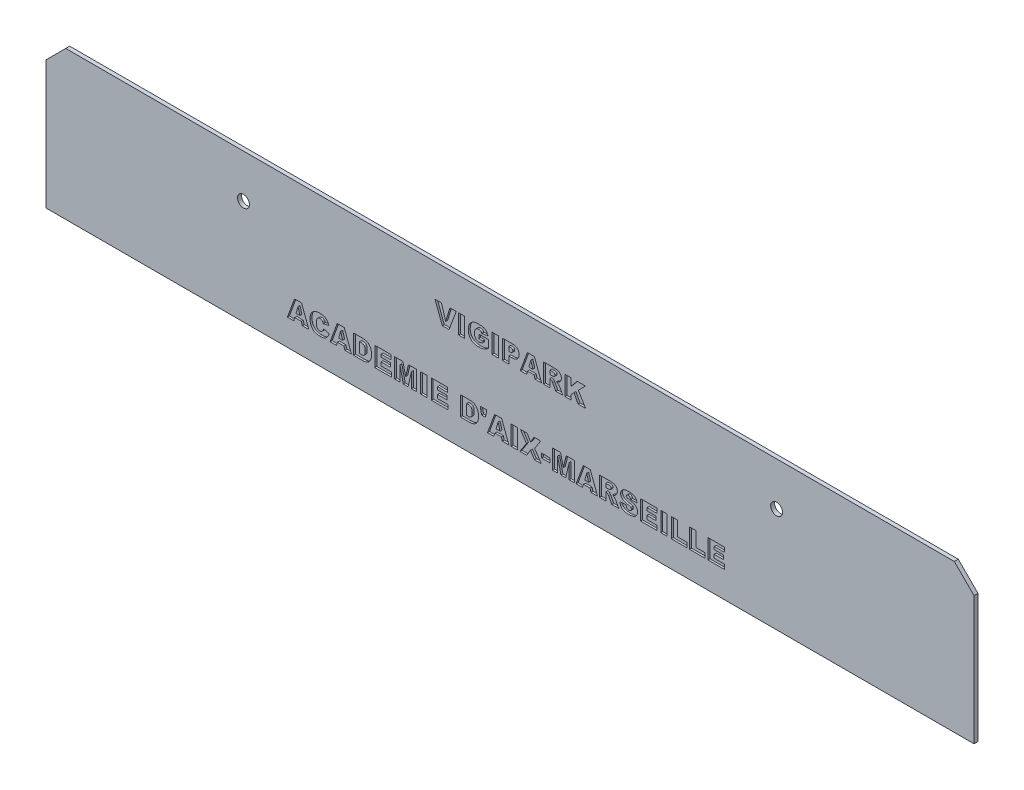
from build123d import *

# Parameters (mm, degrees)
PLAQUE_DE_BASE_DEPTH   = 1
TROU_RIVETS_DEPTH      = 247.679954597
TROU_RIVETS_DEPTH_BACK = 247.679954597
ESQUISSE2_R            = 3
ESQUISSE3_W            = 3.168127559
ESQUISSE3_H            = 9.757832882
ESQUISSE3_W_2          = 3.178840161
ESQUISSE3_H_2          = 9.790827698
ESQUISSE3_W_3          = 3.178840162
ESQUISSE3_W_4          = 4.196069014
ESQUISSE3_H_3          = 2.16161131
TESTE_DEPTH            = 1


with BuildPart() as part:
    # Esquisse1 → Plaque de base (new, symmetric)
    with BuildSketch(Plane.XY):
        Polygon((-235, 65), (-225, 75), (225, 75), (235, 65), (235, 0), (-235, 0), align=None)
    extrude(amount=PLAQUE_DE_BASE_DEPTH, both=True)

    # Esquisse2 → Trou rivets (cut, two sides: drawn at the far end of the back side and taken through both)
    with BuildSketch(Plane.XY.offset(-TROU_RIVETS_DEPTH_BACK)):
        with Locations((-135, 53)):
            Circle(ESQUISSE2_R)
        with Locations((135, 53)):
            Circle(ESQUISSE2_R)
    extrude(amount=TROU_RIVETS_DEPTH + TROU_RIVETS_DEPTH_BACK, mode=Mode.SUBTRACT)

    # Esquisse3 → Teste (cut)
    # profile 1 of 31: a face of its own
    with BuildSketch(Plane.XY.offset(1)):
        Polygon((-38.01102416, 58.524643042), (-34.716171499, 58.524643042), (-32.563824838, 51.503280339), (-30.441179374, 58.524643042), (-27.239390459, 58.524643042), (-30.884717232, 48.76681016), (-34.300354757, 48.76681016), align=None)
    # profile 2 of 31: a face of its own
    with BuildSketch(Plane.XY.offset(1)):
        with Locations((-24.514800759, 53.645726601)):
            Rectangle(ESQUISSE3_W, ESQUISSE3_H)
    # profile 3 of 31: a face of its own
    with BuildSketch(Plane.XY.offset(1)):
        with BuildLine():
            Line((-15.834131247, 52.315113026), (-15.834131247, 54.342714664))
            Line((-15.834131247, 54.342714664), (-11.018577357, 54.342714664))
            Line((-11.018577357, 54.342714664), (-11.018577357, 50.317212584))
            add(Edge.make_bspline(
                [(-11.018577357, 50.317212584), (-11.128993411, 50.238648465), (-11.344572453, 50.085257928), (-11.668280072, 49.871925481), (-11.979534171, 49.675424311), (-12.282768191, 49.499864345), (-12.576069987, 49.344053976), (-12.860289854, 49.207130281), (-13.132751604, 49.086960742), (-13.401298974, 48.988006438), (-13.673374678, 48.906104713), (-13.956886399, 48.835048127), (-14.256018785, 48.77345227), (-14.571230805, 48.724182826), (-14.902312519, 48.68746603), (-15.249593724, 48.659181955), (-15.612885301, 48.643954), (-15.860519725, 48.641390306), (-15.986597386, 48.640085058)],
                knots=[0, 0, 0, 0, 1.214319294, 2.370867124, 3.473714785, 4.512576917, 5.510103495, 6.449244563, 7.339308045, 8.177675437, 9.012194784, 9.884410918, 10.796182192, 11.748198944, 12.742352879, 13.780760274, 14.870122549, 16, 16, 16, 16], degree=3))
            add(Edge.make_bspline(
                [(-15.986597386, 48.640085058), (-16.129208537, 48.642052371), (-16.408105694, 48.645899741), (-16.815843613, 48.673933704), (-17.203131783, 48.719180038), (-17.570408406, 48.781553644), (-17.917486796, 48.864974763), (-18.244974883, 48.96584964), (-18.552982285, 49.083539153), (-18.839626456, 49.223541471), (-19.108573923, 49.381102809), (-19.362398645, 49.555312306), (-19.600917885, 49.747114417), (-19.821203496, 49.959788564), (-20.029920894, 50.186084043), (-20.220208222, 50.433265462), (-20.39456216, 50.697861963), (-20.554614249, 50.977981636), (-20.697116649, 51.272930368), (-20.820244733, 51.580572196), (-20.922114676, 51.899305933), (-21.007948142, 52.227713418), (-21.075560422, 52.566783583), (-21.122548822, 52.917292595), (-21.15054036, 53.278293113), (-21.154554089, 53.522252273), (-21.156585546, 53.645726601)],
                knots=[0, 0, 0, 0, 1.253917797, 2.452221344, 3.591772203, 4.681385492, 5.725859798, 6.728156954, 7.692763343, 8.621995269, 9.52977499, 10.431262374, 11.326770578, 12.217527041, 13.121290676, 14.03140493, 14.956950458, 15.905713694, 16.866120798, 17.834977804, 18.81688793, 19.806469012, 20.818314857, 21.854955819, 22.914335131, 24, 24, 24, 24], degree=3))
            add(Edge.make_bspline(
                [(-21.156585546, 53.645726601), (-21.154956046, 53.775826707), (-21.151749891, 54.031807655), (-21.118305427, 54.409184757), (-21.068382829, 54.773830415), (-20.994164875, 55.125416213), (-20.901628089, 55.464209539), (-20.78852972, 55.790626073), (-20.654144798, 56.103969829), (-20.496938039, 56.40323441), (-20.321870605, 56.687753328), (-20.126358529, 56.955651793), (-19.910355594, 57.204576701), (-19.676006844, 57.436827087), (-19.423445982, 57.652663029), (-19.149406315, 57.847411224), (-18.857812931, 58.027812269), (-18.651345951, 58.130242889), (-18.546840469, 58.182089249)],
                knots=[0, 0, 0, 0, 1.125501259, 2.214501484, 3.275832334, 4.308594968, 5.321456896, 6.313082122, 7.295503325, 8.268817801, 9.235659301, 10.183814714, 11.135352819, 12.084419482, 13.036574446, 14.006582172, 14.991010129, 16, 16, 16, 16], degree=3))
            add(Edge.make_bspline(
                [(-18.546840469, 58.182089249), (-18.460262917, 58.220411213), (-18.28317966, 58.298793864), (-17.99945616, 58.393362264), (-17.694471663, 58.470569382), (-17.368513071, 58.539355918), (-17.020596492, 58.589701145), (-16.651159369, 58.624545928), (-16.260777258, 58.64671684), (-15.993228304, 58.649790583), (-15.855912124, 58.651368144)],
                knots=[0, 0, 0, 0, 0.82525077, 1.687944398, 2.603683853, 3.567637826, 4.591578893, 5.667081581, 6.802658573, 8, 8, 8, 8], degree=3))
            add(Edge.make_bspline(
                [(-15.855912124, 58.651368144), (-15.713993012, 58.6508328), (-15.440640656, 58.649801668), (-15.045136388, 58.635665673), (-14.679869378, 58.612947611), (-14.343860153, 58.578628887), (-14.037655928, 58.538784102), (-13.760764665, 58.487054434), (-13.513472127, 58.427563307), (-13.226754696, 58.331837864), (-12.901202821, 58.190119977), (-12.545247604, 57.976266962), (-12.223664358, 57.721350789), (-11.938264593, 57.422856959), (-11.687715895, 57.082688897), (-11.46914147, 56.701568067), (-11.283828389, 56.277863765), (-11.192345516, 55.975393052), (-11.14530246, 55.819854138)],
                knots=[0, 0, 0, 0, 1.126010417, 2.168824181, 3.139711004, 4.029235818, 4.848391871, 5.588964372, 6.263424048, 6.864588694, 7.985509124, 9.073161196, 10.150323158, 11.231868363, 12.340041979, 13.49434115, 14.711520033, 16, 16, 16, 16], degree=3))
            Line((-11.14530246, 55.819854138), (-14.30748978, 55.356515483))
            add(Edge.make_bspline(
                [(-14.30748978, 55.356515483), (-14.340814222, 55.434885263), (-14.406056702, 55.588317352), (-14.541988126, 55.795792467), (-14.712117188, 55.970296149), (-14.910544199, 56.116459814), (-15.138434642, 56.232217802), (-15.396112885, 56.312332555), (-15.68166586, 56.362883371), (-15.882083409, 56.367768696), (-15.986597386, 56.370316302)],
                knots=[0, 0, 0, 0, 0.970787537, 1.900604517, 2.811676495, 3.738344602, 4.701943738, 5.714510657, 6.808160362, 8, 8, 8, 8], degree=3))
            add(Edge.make_bspline(
                [(-15.986597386, 56.370316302), (-16.056001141, 56.368458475), (-16.192167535, 56.364813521), (-16.392272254, 56.334723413), (-16.583271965, 56.282674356), (-16.766577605, 56.211108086), (-16.941714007, 56.119275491), (-17.108643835, 56.00819726), (-17.266330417, 55.875782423), (-17.414419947, 55.723923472), (-17.551207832, 55.549936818), (-17.669444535, 55.351674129), (-17.768509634, 55.129381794), (-17.849369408, 54.884500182), (-17.912030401, 54.616063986), (-17.957397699, 54.324891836), (-17.982211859, 54.009831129), (-17.986323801, 53.792294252), (-17.988457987, 53.679387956)],
                knots=[0, 0, 0, 0, 0.880234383, 1.726971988, 2.559807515, 3.387067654, 4.218555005, 5.063925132, 5.925927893, 6.826012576, 7.750652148, 8.727184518, 9.746611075, 10.832289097, 11.994062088, 13.239971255, 14.567486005, 16, 16, 16, 16], degree=3))
            add(Edge.make_bspline(
                [(-17.988457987, 53.679387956), (-17.986510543, 53.559872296), (-17.982760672, 53.32974067), (-17.955562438, 52.997551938), (-17.908242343, 52.691877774), (-17.843846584, 52.412167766), (-17.761245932, 52.158252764), (-17.658297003, 51.93068871), (-17.535753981, 51.729336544), (-17.393524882, 51.555040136), (-17.235632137, 51.406744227), (-17.068096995, 51.277500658), (-16.891367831, 51.164049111), (-16.70061746, 51.076652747), (-16.5006738, 51.005837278), (-16.290117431, 50.957162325), (-16.06868897, 50.926433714), (-15.917399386, 50.922928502), (-15.840071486, 50.9211369)],
                knots=[0, 0, 0, 0, 1.441714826, 2.776072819, 4.017058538, 5.170071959, 6.235138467, 7.232804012, 8.176421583, 9.070535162, 9.937871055, 10.783556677, 11.620804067, 12.464989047, 13.308573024, 14.175726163, 15.067567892, 16, 16, 16, 16], degree=3))
            add(Edge.make_bspline(
                [(-15.840071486, 50.9211369), (-15.756168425, 50.922416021), (-15.58927936, 50.924960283), (-15.342811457, 50.95273166), (-15.101564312, 50.990804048), (-14.863434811, 51.049996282), (-14.619948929, 51.129621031), (-14.362490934, 51.22857035), (-14.088514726, 51.352223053), (-13.903124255, 51.447629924), (-13.806529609, 51.4973401)],
                knots=[0, 0, 0, 0, 0.941933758, 1.873572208, 2.782730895, 3.683509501, 4.625939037, 5.658467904, 6.779983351, 8, 8, 8, 8], degree=3))
            Line((-13.806529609, 51.4973401), (-13.806529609, 52.315113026))
            Line((-13.806529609, 52.315113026), (-15.834131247, 52.315113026))
        make_face()
    # profile 4 of 31: a face of its own
    with BuildSketch(Plane.XY.offset(1)):
        with Locations((-7.533637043, 53.645726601)):
            Rectangle(ESQUISSE3_W, ESQUISSE3_H)
    # profile 5 of 31: a face of its own
    with BuildSketch(Plane.XY.offset(1)):
        with BuildLine():
            Line((-3.795246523, 58.524643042), (1.190594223, 58.524643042))
            add(Edge.make_bspline(
                [(1.190594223, 58.524643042), (1.331929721, 58.522681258), (1.605897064, 58.5188785), (2.00158314, 58.480710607), (2.36830094, 58.419808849), (2.705740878, 58.336489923), (3.013665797, 58.224924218), (3.291947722, 58.089157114), (3.540274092, 57.927009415), (3.760364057, 57.741971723), (3.950769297, 57.532171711), (4.116744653, 57.3022911), (4.257371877, 57.05184997), (4.373513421, 56.780707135), (4.459456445, 56.487148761), (4.52189608, 56.173740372), (4.563350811, 55.840094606), (4.566827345, 55.610754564), (4.568610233, 55.493140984)],
                knots=[0, 0, 0, 0, 1.303628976, 2.526978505, 3.663205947, 4.730994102, 5.728827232, 6.679250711, 7.58115036, 8.458288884, 9.324623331, 10.188235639, 11.068918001, 11.969233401, 12.903603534, 13.885252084, 14.915483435, 16, 16, 16, 16], degree=3))
            add(Edge.make_bspline(
                [(4.568610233, 55.493140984), (4.566193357, 55.371550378), (4.561489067, 55.134882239), (4.517922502, 54.790687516), (4.453300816, 54.466187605), (4.353751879, 54.16340367), (4.23305357, 53.878120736), (4.078108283, 53.61595975), (3.899967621, 53.372219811), (3.691796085, 53.151027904), (3.455426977, 52.950354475), (3.182518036, 52.780012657), (2.87783189, 52.635901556), (2.541534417, 52.516989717), (2.171923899, 52.426673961), (1.769932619, 52.362820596), (1.335283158, 52.322798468), (1.034918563, 52.317731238), (0.879721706, 52.315113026)],
                knots=[0, 0, 0, 0, 1.047130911, 2.038171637, 2.985073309, 3.893273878, 4.779632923, 5.648674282, 6.510822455, 7.375835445, 8.259783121, 9.174848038, 10.138893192, 11.158737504, 12.242833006, 13.412410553, 14.663005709, 16, 16, 16, 16], degree=3))
            Line((0.879721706, 52.315113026), (-0.627118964, 52.315113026))
            Line((-0.627118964, 52.315113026), (-0.627118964, 48.76681016))
            Line((-0.627118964, 48.76681016), (-3.795246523, 48.76681016))
            Line((-3.795246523, 48.76681016), (-3.795246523, 58.524643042))
        make_face()
        with BuildLine():
            Line((-0.627118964, 54.342714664), (-0.066756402, 54.342714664))
            add(Edge.make_bspline(
                [(-0.066756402, 54.342714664), (-0.001386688, 54.343258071), (0.124235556, 54.344302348), (0.304788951, 54.35820343), (0.470314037, 54.381439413), (0.620417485, 54.415188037), (0.756244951, 54.45573245), (0.876469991, 54.507649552), (0.981816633, 54.568525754), (1.100409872, 54.66117328), (1.221396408, 54.795845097), (1.326409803, 54.981684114), (1.39071472, 55.189342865), (1.397159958, 55.334925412), (1.400482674, 55.409977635)],
                knots=[0, 0, 0, 0, 1.140602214, 2.191917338, 3.157925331, 4.054994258, 4.874779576, 5.628012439, 6.335275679, 6.991953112, 8.247986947, 9.465288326, 10.693279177, 12, 12, 12, 12], degree=3))
            add(Edge.make_bspline(
                [(1.400482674, 55.409977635), (1.397364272, 55.483608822), (1.391318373, 55.626363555), (1.335332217, 55.831288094), (1.24526039, 56.018298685), (1.140353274, 56.158366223), (1.037269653, 56.259539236), (0.939199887, 56.322166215), (0.828950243, 56.378266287), (0.701169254, 56.420828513), (0.559781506, 56.45704435), (0.401047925, 56.478951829), (0.227993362, 56.496166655), (0.106882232, 56.496742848), (0.044128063, 56.497041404)],
                knots=[0, 0, 0, 0, 1.331134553, 2.580778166, 3.815700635, 5.070763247, 5.730238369, 6.419791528, 7.168166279, 7.965798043, 8.852899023, 9.808015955, 10.864215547, 12, 12, 12, 12], degree=3))
            Line((0.044128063, 56.497041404), (-0.627118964, 56.497041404))
            Line((-0.627118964, 56.497041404), (-0.627118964, 54.342714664))
        make_face(mode=Mode.SUBTRACT)
    # profile 6 of 31: a face of its own
    with BuildSketch(Plane.XY.offset(1)):
        Polygon((12.182016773, 50.414236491), (8.910925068, 50.414236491), (8.417885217, 48.76681016), (5.202235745, 48.76681016), (8.778259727, 58.524643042), (12.336462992, 58.524643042), (15.973869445, 48.76681016), (12.675056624, 48.76681016), align=None)
        Polygon((11.536510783, 52.568563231), (10.522709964, 56.029742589), (9.554450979, 52.568563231), align=None, mode=Mode.SUBTRACT)
    # profile 7 of 31: a face of its own
    with BuildSketch(Plane.XY.offset(1)):
        with BuildLine():
            Line((16.987670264, 48.76681016), (16.987670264, 58.524643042))
            Line((16.987670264, 58.524643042), (22.050734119, 58.524643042))
            add(Edge.make_bspline(
                [(22.050734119, 58.524643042), (22.174831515, 58.523989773), (22.414506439, 58.522728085), (22.761074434, 58.510107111), (23.082669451, 58.49303923), (23.380058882, 58.468373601), (23.652668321, 58.432277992), (23.900357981, 58.390932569), (24.123894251, 58.345156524), (24.324323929, 58.285930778), (24.509859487, 58.221005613), (24.682969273, 58.14159695), (24.845896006, 58.046753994), (25.002221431, 57.943540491), (25.147979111, 57.824774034), (25.285197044, 57.694382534), (25.411375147, 57.548611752), (25.530137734, 57.393210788), (25.637479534, 57.226731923), (25.730550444, 57.049733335), (25.810258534, 56.86391163), (25.872424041, 56.668424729), (25.9254132, 56.465947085), (25.960575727, 56.253222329), (25.979703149, 56.031417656), (25.98331697, 55.880611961), (25.985152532, 55.8040135)],
                knots=[0, 0, 0, 0, 1.62468293, 3.137823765, 4.539895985, 5.840971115, 7.043591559, 8.138909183, 9.128722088, 10.02847004, 10.873079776, 11.700540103, 12.51728205, 13.339355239, 14.150454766, 14.975565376, 15.814497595, 16.671744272, 17.534677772, 18.404420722, 19.287202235, 20.178067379, 21.087679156, 22.025305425, 22.996997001, 24, 24, 24, 24], degree=3))
            add(Edge.make_bspline(
                [(25.985152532, 55.8040135), (25.981391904, 55.673011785), (25.974064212, 55.417751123), (25.905015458, 55.049525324), (25.794488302, 54.70754446), (25.636532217, 54.395921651), (25.440580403, 54.112669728), (25.21078833, 53.85758875), (24.948127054, 53.628629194), (24.750697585, 53.503335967), (24.650578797, 53.43979831)],
                knots=[0, 0, 0, 0, 1.101993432, 2.147266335, 3.141901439, 4.118584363, 5.077365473, 6.033582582, 7.002806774, 8, 8, 8, 8], degree=3))
            add(Edge.make_bspline(
                [(24.650578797, 53.43979831), (24.579264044, 53.401530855), (24.427547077, 53.320119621), (24.172624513, 53.218817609), (23.880731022, 53.12890723), (23.672724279, 53.078282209), (23.563515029, 53.051702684)],
                knots=[0, 0, 0, 0, 0.837915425, 1.782604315, 2.835806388, 4, 4, 4, 4], degree=3))
            add(Edge.make_bspline(
                [(23.563515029, 53.051702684), (23.647041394, 53.022289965), (23.803093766, 52.96733816), (24.016492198, 52.876395), (24.193854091, 52.784932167), (24.295339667, 52.716595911), (24.34168636, 52.685387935)],
                knots=[0, 0, 0, 0, 1.231012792, 2.299902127, 3.223594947, 4, 4, 4, 4], degree=3))
            add(Edge.make_bspline(
                [(24.34168636, 52.685387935), (24.372529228, 52.66017746), (24.444238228, 52.601563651), (24.553365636, 52.486767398), (24.681334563, 52.338117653), (24.820000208, 52.164036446), (24.957982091, 51.986105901), (25.076737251, 51.820700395), (25.169589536, 51.678403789), (25.217394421, 51.588721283), (25.238662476, 51.548822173)],
                knots=[0, 0, 0, 0, 0.656872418, 1.527214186, 2.608218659, 3.894218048, 5.199173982, 6.323536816, 7.254153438, 8, 8, 8, 8], degree=3))
            Line((25.238662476, 51.548822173), (26.745503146, 48.76681016))
            Line((26.745503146, 48.76681016), (23.187299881, 48.76681016))
            Line((23.187299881, 48.76681016), (21.583435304, 51.725049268))
            add(Edge.make_bspline(
                [(21.583435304, 51.725049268), (21.535239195, 51.812985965), (21.446277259, 51.975302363), (21.305307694, 52.187500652), (21.17658122, 52.355392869), (21.079819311, 52.435870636), (21.0369333, 52.471539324)],
                knots=[0, 0, 0, 0, 1.29093653, 2.38285239, 3.283261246, 4, 4, 4, 4], degree=3))
            add(Edge.make_bspline(
                [(21.0369333, 52.471539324), (20.981740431, 52.505617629), (20.871495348, 52.573687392), (20.689625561, 52.644673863), (20.496415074, 52.687757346), (20.363935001, 52.692745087), (20.296383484, 52.695288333)],
                knots=[0, 0, 0, 0, 0.98982165, 1.977120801, 2.968535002, 4, 4, 4, 4], degree=3))
            Line((20.296383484, 52.695288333), (20.155797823, 52.695288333))
            Line((20.155797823, 52.695288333), (20.155797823, 48.76681016))
            Line((20.155797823, 48.76681016), (16.987670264, 48.76681016))
        make_face()
        with BuildLine():
            Line((20.155797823, 54.596164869), (21.318104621, 54.596164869))
            add(Edge.make_bspline(
                [(21.318104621, 54.596164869), (21.361061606, 54.598198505), (21.463910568, 54.603067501), (21.642093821, 54.629818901), (21.869232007, 54.669117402), (22.036315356, 54.703843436), (22.127957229, 54.722889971)],
                knots=[0, 0, 0, 0, 0.628542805, 1.504876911, 2.631474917, 4, 4, 4, 4], degree=3))
            add(Edge.make_bspline(
                [(22.127957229, 54.722889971), (22.176747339, 54.734269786), (22.273398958, 54.756812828), (22.406116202, 54.82203232), (22.526382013, 54.906415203), (22.628203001, 55.013345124), (22.711088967, 55.136206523), (22.773276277, 55.268822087), (22.810591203, 55.411271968), (22.814851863, 55.508760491), (22.817024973, 55.558483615)],
                knots=[0, 0, 0, 0, 1.020158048, 2.02089986, 2.99701443, 4.007421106, 5.016748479, 6.011755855, 6.985914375, 8, 8, 8, 8], degree=3))
            add(Edge.make_bspline(
                [(22.817024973, 55.558483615), (22.813258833, 55.630108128), (22.806086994, 55.766502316), (22.750663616, 55.959991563), (22.649970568, 56.12362078), (22.537623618, 56.238420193), (22.427110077, 56.315340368), (22.324630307, 56.364245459), (22.206154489, 56.40489333), (22.070887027, 56.438339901), (21.920264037, 56.466290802), (21.752001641, 56.482446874), (21.567790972, 56.495255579), (21.438917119, 56.496428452), (21.371566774, 56.497041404)],
                knots=[0, 0, 0, 0, 1.307875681, 2.490580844, 3.632121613, 4.783239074, 5.398689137, 6.08357963, 6.850117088, 7.683629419, 8.627346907, 9.646048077, 10.76980885, 12, 12, 12, 12], degree=3))
            Line((21.371566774, 56.497041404), (20.155797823, 56.497041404))
            Line((20.155797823, 56.497041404), (20.155797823, 54.596164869))
        make_face(mode=Mode.SUBTRACT)
    # profile 8 of 31: a face of its own
    with BuildSketch(Plane.XY.offset(1)):
        Polygon((27.759303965, 58.524643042), (30.927431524, 58.524643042), (30.923471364, 54.837734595), (33.982694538, 58.524643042), (38.150762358, 58.524643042), (34.586618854, 54.87337603), (38.277487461, 48.76681016), (34.434152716, 48.76681016), (32.438232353, 52.758650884), (30.927431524, 51.125085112), (30.927431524, 48.76681016), (27.759303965, 48.76681016), align=None)
    # profile 9 of 31: a face of its own
    with BuildSketch(Plane.XY.offset(1)):
        Polygon((-105.73771511, 14.949012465), (-109.019867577, 14.949012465), (-109.514574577, 13.296015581), (-112.741097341, 13.296015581), (-109.152981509, 23.086843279), (-105.582746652, 23.086843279), (-101.933040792, 13.296015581), (-105.24300811, 13.296015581), align=None)
        Polygon((-106.385403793, 17.110623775), (-107.402632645, 20.583506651), (-108.374165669, 17.110623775), align=None, mode=Mode.SUBTRACT)
    # profile 10 of 31: a face of its own
    with BuildSketch(Plane.XY.offset(1)):
        with BuildLine():
            Line((-94.42303091, 17.364930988), (-91.633598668, 16.562273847))
            add(Edge.make_bspline(
                [(-91.633598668, 16.562273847), (-91.656595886, 16.470649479), (-91.702035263, 16.289612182), (-91.783880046, 16.025829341), (-91.874179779, 15.773361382), (-91.977807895, 15.533932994), (-92.084372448, 15.303096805), (-92.207191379, 15.086939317), (-92.336422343, 14.880903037), (-92.51960661, 14.623958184), (-92.77395848, 14.330237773), (-93.114559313, 14.019960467), (-93.492291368, 13.757703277), (-93.83455896, 13.577446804), (-94.129965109, 13.458540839), (-94.372015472, 13.381779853), (-94.631021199, 13.313929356), (-94.909890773, 13.260711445), (-95.206358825, 13.219713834), (-95.521889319, 13.190097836), (-95.855283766, 13.172083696), (-96.083951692, 13.169953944), (-96.201194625, 13.168861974)],
                knots=[0, 0, 0, 0, 0.905665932, 1.789472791, 2.647230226, 3.475229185, 4.290467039, 5.083667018, 5.857098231, 6.621878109, 8.107598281, 9.573205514, 11.028305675, 12.505342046, 13.271833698, 14.079143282, 14.938591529, 15.837777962, 16.799608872, 17.807463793, 18.875839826, 20, 20, 20, 20], degree=3))
            add(Edge.make_bspline(
                [(-96.201194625, 13.168861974), (-96.331681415, 13.170672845), (-96.586182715, 13.174204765), (-96.958796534, 13.193399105), (-97.312992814, 13.228491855), (-97.648760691, 13.281245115), (-97.96770627, 13.343130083), (-98.267491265, 13.422758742), (-98.548896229, 13.516186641), (-98.813695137, 13.6237366), (-99.065716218, 13.749868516), (-99.305217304, 13.899760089), (-99.537962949, 14.06928666), (-99.75951812, 14.263095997), (-99.974946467, 14.476338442), (-100.182604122, 14.711065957), (-100.377565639, 14.970632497), (-100.567661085, 15.247484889), (-100.740642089, 15.546595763), (-100.890261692, 15.868330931), (-101.01462091, 16.21115116), (-101.11746571, 16.573116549), (-101.199674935, 16.954550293), (-101.256434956, 17.356888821), (-101.290197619, 17.779584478), (-101.294884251, 18.068186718), (-101.297272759, 18.215270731)],
                knots=[0, 0, 0, 0, 1.147650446, 2.238376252, 3.280413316, 4.276323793, 5.226689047, 6.13651372, 7.002182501, 7.832854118, 8.648150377, 9.477309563, 10.314915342, 11.177895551, 12.063382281, 12.979505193, 13.931243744, 14.916675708, 15.931699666, 16.966189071, 18.033078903, 19.13554484, 20.273354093, 21.461953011, 22.706502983, 24, 24, 24, 24], degree=3))
            add(Edge.make_bspline(
                [(-101.297272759, 18.215270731), (-101.293933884, 18.410164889), (-101.287431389, 18.789723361), (-101.223293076, 19.34152957), (-101.126694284, 19.860067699), (-100.98587082, 20.343719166), (-100.802111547, 20.790575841), (-100.581227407, 21.204278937), (-100.316928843, 21.581644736), (-100.014337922, 21.924958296), (-99.673837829, 22.229224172), (-99.299014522, 22.493530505), (-98.890472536, 22.717359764), (-98.448509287, 22.899448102), (-97.9731103, 23.041069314), (-97.464849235, 23.140703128), (-96.923324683, 23.203910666), (-96.551048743, 23.210577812), (-96.360136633, 23.213996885)],
                knots=[0, 0, 0, 0, 1.16882947, 2.276307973, 3.328298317, 4.330369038, 5.292534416, 6.222298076, 7.138273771, 8.050302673, 8.962002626, 9.87147472, 10.796156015, 11.750975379, 12.733998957, 13.767258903, 14.854996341, 16, 16, 16, 16], degree=3))
            add(Edge.make_bspline(
                [(-96.360136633, 23.213996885), (-96.200467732, 23.21181446), (-95.889979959, 23.207570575), (-95.438749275, 23.171789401), (-95.016295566, 23.111910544), (-94.62162468, 23.03290335), (-94.256898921, 22.924167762), (-93.918486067, 22.796591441), (-93.610172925, 22.641075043), (-93.327588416, 22.462473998), (-93.070468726, 22.257379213), (-92.830101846, 22.030239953), (-92.609603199, 21.775090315), (-92.401780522, 21.497806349), (-92.215681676, 21.191153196), (-92.04491284, 20.861360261), (-91.891035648, 20.506091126), (-91.804841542, 20.257618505), (-91.760752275, 20.130521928)],
                knots=[0, 0, 0, 0, 1.271753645, 2.473017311, 3.602533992, 4.66921214, 5.675754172, 6.630957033, 7.54633312, 8.421485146, 9.289035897, 10.162198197, 11.051998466, 11.972029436, 12.91931864, 13.905569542, 14.928674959, 16, 16, 16, 16], degree=3))
            Line((-91.760752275, 20.130521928), (-94.550184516, 19.526542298))
            add(Edge.make_bspline(
                [(-94.550184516, 19.526542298), (-94.573914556, 19.597686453), (-94.618234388, 19.730560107), (-94.691711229, 19.912684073), (-94.76562519, 20.064997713), (-94.82225251, 20.152168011), (-94.848200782, 20.192111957)],
                knots=[0, 0, 0, 0, 1.229647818, 2.296573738, 3.219440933, 4, 4, 4, 4], degree=3))
            add(Edge.make_bspline(
                [(-94.848200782, 20.192111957), (-94.891188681, 20.248926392), (-94.975763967, 20.360704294), (-95.125256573, 20.50630617), (-95.2869631, 20.632644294), (-95.462342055, 20.738160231), (-95.650154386, 20.822648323), (-95.849971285, 20.881719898), (-96.060087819, 20.918722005), (-96.203688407, 20.92303787), (-96.276692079, 20.925231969)],
                knots=[0, 0, 0, 0, 1.022346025, 2.011384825, 2.987756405, 3.965193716, 4.94480522, 5.938182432, 6.9518131, 8, 8, 8, 8], degree=3))
            add(Edge.make_bspline(
                [(-96.276692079, 20.925231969), (-96.349047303, 20.923162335), (-96.491475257, 20.919088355), (-96.69932526, 20.880310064), (-96.896536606, 20.816430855), (-97.082214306, 20.72558477), (-97.258687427, 20.612093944), (-97.422414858, 20.47122712), (-97.574205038, 20.305042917), (-97.663393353, 20.180512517), (-97.709156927, 20.116614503)],
                knots=[0, 0, 0, 0, 1.009507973, 1.987170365, 2.940519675, 3.895929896, 4.865511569, 5.862532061, 6.903240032, 8, 8, 8, 8], degree=3))
            add(Edge.make_bspline(
                [(-97.709156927, 20.116614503), (-97.742211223, 20.063655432), (-97.810770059, 19.953811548), (-97.891915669, 19.769412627), (-97.965228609, 19.566260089), (-98.018039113, 19.339752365), (-98.065154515, 19.093474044), (-98.095036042, 18.824461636), (-98.115920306, 18.534813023), (-98.117577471, 18.334519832), (-98.118432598, 18.231164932)],
                knots=[0, 0, 0, 0, 0.765245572, 1.587217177, 2.466349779, 3.412541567, 4.437552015, 5.542455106, 6.731862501, 8, 8, 8, 8], degree=3))
            add(Edge.make_bspline(
                [(-98.118432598, 18.231164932), (-98.116789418, 18.103326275), (-98.113645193, 17.85870697), (-98.093218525, 17.507008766), (-98.053050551, 17.186745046), (-98.000590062, 16.897222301), (-97.934537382, 16.637684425), (-97.848882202, 16.411049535), (-97.751032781, 16.213195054), (-97.633103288, 16.047991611), (-97.504681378, 15.908380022), (-97.368534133, 15.787218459), (-97.223087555, 15.686614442), (-97.07104296, 15.600870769), (-96.908235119, 15.537536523), (-96.737573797, 15.492392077), (-96.558464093, 15.463356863), (-96.436409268, 15.459564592), (-96.374044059, 15.457626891)],
                knots=[0, 0, 0, 0, 1.653849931, 3.164642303, 4.554584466, 5.826623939, 6.969552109, 8.013396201, 8.955958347, 9.816452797, 10.629040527, 11.405979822, 12.168905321, 12.912833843, 13.658979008, 14.42166395, 15.193532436, 16, 16, 16, 16], degree=3))
            add(Edge.make_bspline(
                [(-96.374044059, 15.457626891), (-96.304466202, 15.459324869), (-96.168930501, 15.462632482), (-95.971729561, 15.483268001), (-95.788417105, 15.52371112), (-95.618136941, 15.577492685), (-95.460124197, 15.644377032), (-95.315843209, 15.728364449), (-95.185311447, 15.828894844), (-95.067879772, 15.945405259), (-94.960277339, 16.075740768), (-94.860606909, 16.219322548), (-94.769790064, 16.377500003), (-94.683759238, 16.547260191), (-94.609237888, 16.732986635), (-94.53692194, 16.929630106), (-94.475768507, 17.142469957), (-94.440963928, 17.289284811), (-94.42303091, 17.364930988)],
                knots=[0, 0, 0, 0, 1.109348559, 2.160979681, 3.154962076, 4.096540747, 5.004552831, 5.884575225, 6.750360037, 7.623835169, 8.515996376, 9.441456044, 10.406593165, 11.421712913, 12.472601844, 13.594687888, 14.76066582, 16, 16, 16, 16], degree=3))
        make_face()
    # profile 11 of 31: a face of its own
    with BuildSketch(Plane.XY.offset(1)):
        Polygon((-84.121602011, 14.949012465), (-87.403754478, 14.949012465), (-87.898461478, 13.296015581), (-91.124984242, 13.296015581), (-87.53686841, 23.086843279), (-83.966633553, 23.086843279), (-80.316927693, 13.296015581), (-83.626895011, 13.296015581), align=None)
        Polygon((-84.769290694, 17.110623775), (-85.786519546, 20.583506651), (-86.75805257, 17.110623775), align=None, mode=Mode.SUBTRACT)
    # profile 12 of 31: a face of its own
    with BuildSketch(Plane.XY.offset(1)):
        with BuildLine():
            Line((-79.299698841, 23.086843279), (-74.795679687, 23.086843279))
            add(Edge.make_bspline(
                [(-74.795679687, 23.086843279), (-74.677792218, 23.085465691), (-74.44786846, 23.082778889), (-74.112938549, 23.068734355), (-73.797889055, 23.036541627), (-73.502193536, 23.001976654), (-73.227373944, 22.948891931), (-72.971717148, 22.888003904), (-72.735454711, 22.815824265), (-72.45119985, 22.700922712), (-72.121693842, 22.537105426), (-71.764153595, 22.293121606), (-71.438794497, 22.014889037), (-71.155368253, 21.694116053), (-70.905857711, 21.34293772), (-70.693210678, 20.962388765), (-70.517246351, 20.553495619), (-70.380187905, 20.119516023), (-70.276945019, 19.665765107), (-70.197511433, 19.19841955), (-70.154803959, 18.716076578), (-70.148055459, 18.390181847), (-70.144639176, 18.225204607)],
                knots=[0, 0, 0, 0, 0.915999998, 1.786535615, 2.603154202, 3.376017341, 4.098566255, 4.776209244, 5.41741812, 6.015539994, 7.156877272, 8.268579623, 9.370258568, 10.474397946, 11.585135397, 12.711599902, 13.854745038, 15.037736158, 16.242151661, 17.467843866, 18.71815009, 20, 20, 20, 20], degree=3))
            add(Edge.make_bspline(
                [(-70.144639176, 18.225204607), (-70.145897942, 18.098035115), (-70.14834437, 17.850879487), (-70.163929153, 17.49102077), (-70.190954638, 17.15356852), (-70.231328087, 16.838212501), (-70.279839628, 16.544202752), (-70.340624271, 16.271938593), (-70.41479681, 16.022106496), (-70.524249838, 15.720565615), (-70.69040728, 15.375401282), (-70.920382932, 14.99230695), (-71.189027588, 14.64669726), (-71.487737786, 14.337928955), (-71.809417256, 14.070242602), (-72.147704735, 13.850384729), (-72.496576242, 13.674218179), (-72.741400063, 13.599310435), (-72.862547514, 13.562243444)],
                knots=[0, 0, 0, 0, 1.046329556, 2.033555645, 2.963016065, 3.830823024, 4.648694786, 5.414076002, 6.12440912, 6.791523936, 8.051661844, 9.269320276, 10.461698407, 11.644726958, 12.797978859, 13.896739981, 14.95923285, 16, 16, 16, 16], degree=3))
            add(Edge.make_bspline(
                [(-72.862547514, 13.562243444), (-73.026923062, 13.520640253), (-73.350864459, 13.438651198), (-73.839600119, 13.360899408), (-74.319503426, 13.304084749), (-74.637896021, 13.298689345), (-74.795679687, 13.296015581)],
                knots=[0, 0, 0, 0, 1.039340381, 2.048269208, 3.032793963, 4, 4, 4, 4], degree=3))
            Line((-74.795679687, 13.296015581), (-79.299698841, 13.296015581))
            Line((-79.299698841, 13.296015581), (-79.299698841, 23.086843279))
        make_face()
        with BuildLine():
            Line((-76.120858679, 20.798078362), (-76.120858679, 15.584780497))
            Line((-76.120858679, 15.584780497), (-75.510918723, 15.584780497))
            add(Edge.make_bspline(
                [(-75.510918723, 15.584780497), (-75.435416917, 15.58585751), (-75.290334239, 15.587927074), (-75.080870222, 15.594875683), (-74.887824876, 15.61016005), (-74.711833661, 15.63501997), (-74.552022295, 15.660865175), (-74.410232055, 15.697388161), (-74.284866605, 15.737984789), (-74.140271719, 15.801992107), (-73.97816406, 15.906120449), (-73.810533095, 16.070516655), (-73.663401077, 16.270943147), (-73.563168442, 16.467008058), (-73.491772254, 16.646576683), (-73.447437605, 16.805256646), (-73.410764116, 16.984121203), (-73.375719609, 17.181215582), (-73.353898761, 17.399081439), (-73.33522698, 17.635510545), (-73.326183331, 17.892021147), (-73.324402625, 18.069569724), (-73.323479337, 18.161627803)],
                knots=[0, 0, 0, 0, 1.128968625, 2.169402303, 3.133129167, 4.022355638, 4.826530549, 5.551792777, 6.209343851, 6.794467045, 7.912352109, 9.067801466, 10.285752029, 11.614390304, 12.348052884, 13.172277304, 14.073387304, 15.077764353, 16.163571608, 17.345240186, 18.623519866, 20, 20, 20, 20], degree=3))
            add(Edge.make_bspline(
                [(-73.323479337, 18.161627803), (-73.324916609, 18.282857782), (-73.32768422, 18.516298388), (-73.351043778, 18.851346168), (-73.390916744, 19.156392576), (-73.442503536, 19.432057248), (-73.513718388, 19.677672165), (-73.601131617, 19.893269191), (-73.701253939, 20.081724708), (-73.823232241, 20.238967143), (-73.961406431, 20.373843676), (-74.12091353, 20.48742149), (-74.300387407, 20.584666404), (-74.500250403, 20.664577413), (-74.721359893, 20.723077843), (-74.961925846, 20.765834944), (-75.223450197, 20.795119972), (-75.404871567, 20.797067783), (-75.498998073, 20.798078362)],
                knots=[0, 0, 0, 0, 1.457208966, 2.806003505, 4.034397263, 5.15384367, 6.174124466, 7.102527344, 7.946917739, 8.730337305, 9.484743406, 10.260276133, 11.0760736, 11.933498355, 12.841190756, 13.820262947, 14.869091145, 16, 16, 16, 16], degree=3))
            Line((-75.498998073, 20.798078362), (-76.120858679, 20.798078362))
        make_face(mode=Mode.SUBTRACT)
    # profile 13 of 31: a face of its own
    with BuildSketch(Plane.XY.offset(1)):
        Polygon((-68.491642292, 23.086843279), (-60.226657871, 23.086843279), (-60.226657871, 20.798078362), (-65.31280213, 20.798078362), (-65.31280213, 19.399388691), (-60.608118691, 19.399388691), (-60.608118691, 17.364930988), (-65.31280213, 17.364930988), (-65.31280213, 15.584780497), (-60.099504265, 15.584780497), (-60.099504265, 13.296015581), (-68.491642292, 13.296015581), align=None)
    # profile 14 of 31: a face of its own
    with BuildSketch(Plane.XY.offset(1)):
        Polygon((-58.446507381, 23.086843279), (-54.248451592, 23.086843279), (-52.847775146, 17.144398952), (-51.441138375, 23.086843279), (-47.256990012, 23.086843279), (-47.256990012, 13.296015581), (-49.927215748, 13.296015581), (-49.927215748, 20.792118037), (-51.65372331, 13.296015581), (-54.051760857, 13.296015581), (-55.784228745, 20.792118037), (-55.776281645, 13.296015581), (-58.446507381, 13.296015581), align=None)
    # profile 15 of 31: a face of its own
    with BuildSketch(Plane.XY.offset(1)):
        with Locations((-43.633112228, 18.19142943)):
            Rectangle(ESQUISSE3_W_2, ESQUISSE3_H_2)
    # profile 16 of 31: a face of its own
    with BuildSketch(Plane.XY.offset(1)):
        Polygon((-39.882080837, 23.086843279), (-31.617096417, 23.086843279), (-31.617096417, 20.798078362), (-36.703240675, 20.798078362), (-36.703240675, 19.399388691), (-31.998557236, 19.399388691), (-31.998557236, 17.364930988), (-36.703240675, 17.364930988), (-36.703240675, 15.584780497), (-31.48994281, 15.584780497), (-31.48994281, 13.296015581), (-39.882080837, 13.296015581), align=None)
    # profile 17 of 31: a face of its own
    with BuildSketch(Plane.XY.offset(1)):
        with BuildLine():
            Line((-25.132262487, 23.086843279), (-20.628243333, 23.086843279))
            add(Edge.make_bspline(
                [(-20.628243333, 23.086843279), (-20.510355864, 23.085465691), (-20.280432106, 23.082778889), (-19.945502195, 23.068734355), (-19.630452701, 23.036541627), (-19.334757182, 23.001976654), (-19.05993759, 22.948891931), (-18.804280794, 22.888003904), (-18.568018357, 22.815824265), (-18.283763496, 22.700922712), (-17.954257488, 22.537105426), (-17.596717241, 22.293121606), (-17.271358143, 22.014889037), (-16.987931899, 21.694116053), (-16.738421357, 21.34293772), (-16.525774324, 20.962388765), (-16.349809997, 20.553495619), (-16.212751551, 20.119516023), (-16.109508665, 19.665765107), (-16.030075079, 19.19841955), (-15.987367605, 18.716076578), (-15.980619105, 18.390181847), (-15.977202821, 18.225204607)],
                knots=[0, 0, 0, 0, 0.915999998, 1.786535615, 2.603154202, 3.376017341, 4.098566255, 4.776209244, 5.41741812, 6.015539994, 7.156877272, 8.268579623, 9.370258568, 10.474397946, 11.585135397, 12.711599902, 13.854745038, 15.037736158, 16.242151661, 17.467843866, 18.71815009, 20, 20, 20, 20], degree=3))
            add(Edge.make_bspline(
                [(-15.977202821, 18.225204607), (-15.978461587, 18.098035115), (-15.980908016, 17.850879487), (-15.996492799, 17.49102077), (-16.023518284, 17.15356852), (-16.063891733, 16.838212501), (-16.112403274, 16.544202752), (-16.173187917, 16.271938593), (-16.247360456, 16.022106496), (-16.356813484, 15.720565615), (-16.522970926, 15.375401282), (-16.752946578, 14.99230695), (-17.021591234, 14.64669726), (-17.320301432, 14.337928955), (-17.641980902, 14.070242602), (-17.980268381, 13.850384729), (-18.329139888, 13.674218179), (-18.573963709, 13.599310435), (-18.69511116, 13.562243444)],
                knots=[0, 0, 0, 0, 1.046329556, 2.033555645, 2.963016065, 3.830823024, 4.648694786, 5.414076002, 6.12440912, 6.791523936, 8.051661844, 9.269320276, 10.461698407, 11.644726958, 12.797978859, 13.896739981, 14.95923285, 16, 16, 16, 16], degree=3))
            add(Edge.make_bspline(
                [(-18.69511116, 13.562243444), (-18.859486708, 13.520640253), (-19.183428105, 13.438651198), (-19.672163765, 13.360899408), (-20.152067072, 13.304084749), (-20.470459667, 13.298689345), (-20.628243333, 13.296015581)],
                knots=[0, 0, 0, 0, 1.039340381, 2.048269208, 3.032793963, 4, 4, 4, 4], degree=3))
            Line((-20.628243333, 13.296015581), (-25.132262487, 13.296015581))
            Line((-25.132262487, 13.296015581), (-25.132262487, 23.086843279))
        make_face()
        with BuildLine():
            Line((-21.953422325, 20.798078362), (-21.953422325, 15.584780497))
            Line((-21.953422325, 15.584780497), (-21.343482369, 15.584780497))
            add(Edge.make_bspline(
                [(-21.343482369, 15.584780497), (-21.267980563, 15.58585751), (-21.122897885, 15.587927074), (-20.913433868, 15.594875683), (-20.720388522, 15.61016005), (-20.544397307, 15.63501997), (-20.384585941, 15.660865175), (-20.242795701, 15.697388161), (-20.117430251, 15.737984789), (-19.972835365, 15.801992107), (-19.810727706, 15.906120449), (-19.643096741, 16.070516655), (-19.495964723, 16.270943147), (-19.395732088, 16.467008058), (-19.3243359, 16.646576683), (-19.280001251, 16.805256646), (-19.243327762, 16.984121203), (-19.208283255, 17.181215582), (-19.186462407, 17.399081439), (-19.167790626, 17.635510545), (-19.158746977, 17.892021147), (-19.156966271, 18.069569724), (-19.156042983, 18.161627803)],
                knots=[0, 0, 0, 0, 1.128968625, 2.169402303, 3.133129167, 4.022355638, 4.826530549, 5.551792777, 6.209343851, 6.794467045, 7.912352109, 9.067801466, 10.285752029, 11.614390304, 12.348052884, 13.172277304, 14.073387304, 15.077764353, 16.163571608, 17.345240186, 18.623519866, 20, 20, 20, 20], degree=3))
            add(Edge.make_bspline(
                [(-19.156042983, 18.161627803), (-19.157480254, 18.282857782), (-19.160247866, 18.516298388), (-19.183607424, 18.851346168), (-19.22348039, 19.156392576), (-19.275067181, 19.432057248), (-19.346282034, 19.677672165), (-19.433695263, 19.893269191), (-19.533817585, 20.081724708), (-19.655795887, 20.238967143), (-19.793970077, 20.373843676), (-19.953477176, 20.48742149), (-20.132951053, 20.584666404), (-20.332814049, 20.664577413), (-20.553923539, 20.723077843), (-20.794489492, 20.765834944), (-21.056013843, 20.795119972), (-21.237435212, 20.797067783), (-21.331561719, 20.798078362)],
                knots=[0, 0, 0, 0, 1.457208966, 2.806003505, 4.034397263, 5.15384367, 6.174124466, 7.102527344, 7.946917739, 8.730337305, 9.484743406, 10.260276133, 11.0760736, 11.933498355, 12.841190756, 13.820262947, 14.869091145, 16, 16, 16, 16], degree=3))
            Line((-21.331561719, 20.798078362), (-21.953422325, 20.798078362))
        make_face(mode=Mode.SUBTRACT)
    # profile 18 of 31: a face of its own
    with BuildSketch(Plane.XY.offset(1)):
        Polygon((-14.832820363, 23.086843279), (-12.035441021, 23.086843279), (-12.035441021, 21.487489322), (-12.456637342, 19.526542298), (-14.399703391, 19.526542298), (-14.832820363, 21.487489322), align=None)
    # profile 19 of 31: a face of its own
    with BuildSketch(Plane.XY.offset(1)):
        Polygon((-4.396290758, 14.949012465), (-7.678443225, 14.949012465), (-8.173150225, 13.296015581), (-11.399672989, 13.296015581), (-7.811557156, 23.086843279), (-4.2413223, 23.086843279), (-0.591616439, 13.296015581), (-3.901583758, 13.296015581), align=None)
        Polygon((-5.043979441, 17.110623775), (-6.061208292, 20.583506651), (-7.032741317, 17.110623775), align=None, mode=Mode.SUBTRACT)
    # profile 20 of 31: a face of its own
    with BuildSketch(Plane.XY.offset(1)):
        with Locations((2.1421861, 18.19142943)):
            Rectangle(ESQUISSE3_W_3, ESQUISSE3_H_2)
    # profile 21 of 31: a face of its own
    with BuildSketch(Plane.XY.offset(1)):
        Polygon((5.257449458, 23.086843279), (8.690596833, 23.086843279), (10.401210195, 20.074892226), (12.123744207, 23.086843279), (15.556891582, 23.086843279), (12.445601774, 18.344411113), (15.811198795, 13.296015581), (12.37805142, 13.296015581), (10.343593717, 16.441080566), (8.43628962, 13.296015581), (5.003142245, 13.296015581), (8.33893764, 18.39805404), align=None)
    # profile 22 of 31: a face of its own
    with BuildSketch(Plane.XY.offset(1)):
        with Locations((18.036386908, 16.919893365)):
            Rectangle(ESQUISSE3_W_4, ESQUISSE3_H_3)
    # profile 23 of 31: a face of its own
    with BuildSketch(Plane.XY.offset(1)):
        Polygon((21.405957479, 23.086843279), (25.604013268, 23.086843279), (27.004689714, 17.144398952), (28.411326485, 23.086843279), (32.595474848, 23.086843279), (32.595474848, 13.296015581), (29.925249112, 13.296015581), (29.925249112, 20.792118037), (28.19874155, 13.296015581), (25.800704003, 13.296015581), (24.068236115, 20.792118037), (24.076183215, 13.296015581), (21.405957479, 13.296015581), align=None)
    # profile 24 of 31: a face of its own
    with BuildSketch(Plane.XY.offset(1)):
        Polygon((40.488932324, 14.949012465), (37.206779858, 14.949012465), (36.712072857, 13.296015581), (33.485550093, 13.296015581), (37.073665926, 23.086843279), (40.643900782, 23.086843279), (44.293606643, 13.296015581), (40.983639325, 13.296015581), align=None)
        Polygon((39.841243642, 17.110623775), (38.82401479, 20.583506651), (37.852481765, 17.110623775), align=None, mode=Mode.SUBTRACT)
    # profile 25 of 31: a face of its own
    with BuildSketch(Plane.XY.offset(1)):
        with BuildLine():
            Line((45.310835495, 13.296015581), (45.310835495, 23.086843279))
            Line((45.310835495, 23.086843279), (50.391019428, 23.086843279))
            add(Edge.make_bspline(
                [(50.391019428, 23.086843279), (50.515536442, 23.086187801), (50.756021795, 23.084921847), (51.103761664, 23.072258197), (51.426444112, 23.055132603), (51.724839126, 23.030383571), (51.998370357, 22.994165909), (52.246897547, 22.952680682), (52.471189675, 22.906749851), (52.67229708, 22.847323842), (52.858460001, 22.78217914), (53.032155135, 22.702501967), (53.195632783, 22.607338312), (53.352486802, 22.503775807), (53.498737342, 22.384607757), (53.63641926, 22.253775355), (53.763024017, 22.107511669), (53.882188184, 21.951585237), (53.989892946, 21.784543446), (54.083278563, 21.606946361), (54.163256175, 21.420496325), (54.225631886, 21.224348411), (54.278800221, 21.021186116), (54.314081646, 20.807742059), (54.333273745, 20.585187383), (54.336899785, 20.433871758), (54.338741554, 20.35701429)],
                knots=[0, 0, 0, 0, 1.62468293, 3.137823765, 4.539895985, 5.840971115, 7.043591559, 8.138909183, 9.128722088, 10.02847004, 10.873079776, 11.700540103, 12.51728205, 13.339355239, 14.150454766, 14.975565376, 15.814497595, 16.671744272, 17.534677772, 18.404420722, 19.287202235, 20.178067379, 21.087679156, 22.025305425, 22.996997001, 24, 24, 24, 24], degree=3))
            add(Edge.make_bspline(
                [(54.338741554, 20.35701429), (54.33496821, 20.22556961), (54.32761574, 19.969445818), (54.258333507, 19.599974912), (54.147432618, 19.256837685), (53.988942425, 18.944161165), (53.792328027, 18.659951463), (53.561758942, 18.404007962), (53.298209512, 18.174274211), (53.100112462, 18.048557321), (52.999655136, 17.984804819)],
                knots=[0, 0, 0, 0, 1.101993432, 2.147266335, 3.141901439, 4.118584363, 5.077365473, 6.033582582, 7.002806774, 8, 8, 8, 8], degree=3))
            add(Edge.make_bspline(
                [(52.999655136, 17.984804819), (52.928099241, 17.946407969), (52.775869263, 17.864721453), (52.520084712, 17.763076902), (52.227204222, 17.672862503), (52.018494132, 17.6220663), (51.908915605, 17.5953969)],
                knots=[0, 0, 0, 0, 0.837915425, 1.782604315, 2.835806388, 4, 4, 4, 4], degree=3))
            add(Edge.make_bspline(
                [(51.908915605, 17.5953969), (51.992724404, 17.565884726), (52.149304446, 17.510747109), (52.363424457, 17.419496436), (52.541386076, 17.327724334), (52.643214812, 17.259157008), (52.68971822, 17.227843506)],
                knots=[0, 0, 0, 0, 1.231012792, 2.299902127, 3.223594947, 4, 4, 4, 4], degree=3))
            add(Edge.make_bspline(
                [(52.68971822, 17.227843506), (52.720665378, 17.202547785), (52.792616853, 17.143735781), (52.902113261, 17.02855136), (53.030514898, 16.879398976), (53.169649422, 16.704729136), (53.308097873, 16.526196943), (53.427254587, 16.36023214), (53.52042084, 16.217454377), (53.568387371, 16.127468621), (53.589727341, 16.087434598)],
                knots=[0, 0, 0, 0, 0.656872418, 1.527214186, 2.608218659, 3.894218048, 5.199173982, 6.323536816, 7.254153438, 8, 8, 8, 8], degree=3))
            Line((53.589727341, 16.087434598), (55.101663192, 13.296015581))
            Line((55.101663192, 13.296015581), (51.531428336, 13.296015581))
            Line((51.531428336, 13.296015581), (49.922140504, 16.264257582))
            add(Edge.make_bspline(
                [(49.922140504, 16.264257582), (49.873781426, 16.352491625), (49.784518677, 16.515356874), (49.643072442, 16.728272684), (49.513910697, 16.896732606), (49.4168216, 16.977482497), (49.373790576, 17.013271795)],
                knots=[0, 0, 0, 0, 1.29093653, 2.38285239, 3.283261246, 4, 4, 4, 4], degree=3))
            add(Edge.make_bspline(
                [(49.373790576, 17.013271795), (49.318411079, 17.047465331), (49.207793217, 17.115765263), (49.025308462, 17.186991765), (48.831444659, 17.230220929), (48.698516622, 17.235225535), (48.630736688, 17.237777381)],
                knots=[0, 0, 0, 0, 0.98982165, 1.977120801, 2.968535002, 4, 4, 4, 4], degree=3))
            Line((48.630736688, 17.237777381), (48.489675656, 17.237777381))
            Line((48.489675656, 17.237777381), (48.489675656, 13.296015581))
            Line((48.489675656, 13.296015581), (45.310835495, 13.296015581))
        make_face()
        with BuildLine():
            Line((48.489675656, 19.145081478), (49.655912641, 19.145081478))
            add(Edge.make_bspline(
                [(49.655912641, 19.145081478), (49.699014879, 19.147121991), (49.80221161, 19.152007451), (49.980997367, 19.178849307), (50.208903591, 19.218280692), (50.376551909, 19.253124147), (50.468503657, 19.272235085)],
                knots=[0, 0, 0, 0, 0.628542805, 1.504876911, 2.631474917, 4, 4, 4, 4], degree=3))
            add(Edge.make_bspline(
                [(50.468503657, 19.272235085), (50.517458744, 19.283653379), (50.614437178, 19.306272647), (50.747603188, 19.37171267), (50.868275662, 19.456380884), (50.970440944, 19.563672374), (51.053607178, 19.686949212), (51.116004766, 19.820013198), (51.153445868, 19.962944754), (51.157720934, 20.060762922), (51.159901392, 20.110654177)],
                knots=[0, 0, 0, 0, 1.020158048, 2.02089986, 2.99701443, 4.007421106, 5.016748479, 6.011755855, 6.985914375, 8, 8, 8, 8], degree=3))
            add(Edge.make_bspline(
                [(51.159901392, 20.110654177), (51.156122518, 20.18252088), (51.148926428, 20.319376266), (51.093315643, 20.513519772), (50.992282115, 20.677702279), (50.879555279, 20.792889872), (50.768668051, 20.870070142), (50.665841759, 20.919140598), (50.546965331, 20.959925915), (50.41124048, 20.993485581), (50.260108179, 21.021530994), (50.091276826, 21.037741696), (49.906443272, 21.050593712), (49.777133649, 21.051770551), (49.709555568, 21.052385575)],
                knots=[0, 0, 0, 0, 1.307875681, 2.490580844, 3.632121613, 4.783239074, 5.398689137, 6.08357963, 6.850117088, 7.683629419, 8.627346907, 9.646048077, 10.76980885, 12, 12, 12, 12], degree=3))
            Line((49.709555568, 21.052385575), (48.489675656, 21.052385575))
            Line((48.489675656, 21.052385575), (48.489675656, 19.145081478))
        make_face(mode=Mode.SUBTRACT)
    # profile 26 of 31: a face of its own
    with BuildSketch(Plane.XY.offset(1)):
        with BuildLine():
            Line((55.610277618, 16.550353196), (58.78911778, 16.729162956))
            add(Edge.make_bspline(
                [(58.78911778, 16.729162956), (58.804797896, 16.619458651), (58.83444517, 16.412034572), (58.91021841, 16.123470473), (59.005733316, 15.874157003), (59.094925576, 15.732669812), (59.136803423, 15.666238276)],
                knots=[0, 0, 0, 0, 1.177086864, 2.225584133, 3.166870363, 4, 4, 4, 4], degree=3))
            add(Edge.make_bspline(
                [(59.136803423, 15.666238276), (59.172909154, 15.619053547), (59.242907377, 15.527576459), (59.361768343, 15.407103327), (59.48750683, 15.304827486), (59.620665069, 15.220775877), (59.761811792, 15.156397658), (59.910024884, 15.110669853), (60.066182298, 15.082020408), (60.173114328, 15.0781408), (60.227542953, 15.076166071)],
                knots=[0, 0, 0, 0, 1.103677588, 2.13970097, 3.137642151, 4.111210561, 5.058820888, 6.012887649, 6.988555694, 8, 8, 8, 8], degree=3))
            add(Edge.make_bspline(
                [(60.227542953, 15.076166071), (60.320515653, 15.080005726), (60.497694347, 15.08732298), (60.747940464, 15.141334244), (60.963415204, 15.238242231), (61.143026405, 15.370103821), (61.279927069, 15.530226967), (61.386105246, 15.701031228), (61.447890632, 15.88798269), (61.455516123, 16.016812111), (61.459343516, 16.081474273)],
                knots=[0, 0, 0, 0, 1.255494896, 2.392604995, 3.433462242, 4.424586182, 5.375455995, 6.262142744, 7.127733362, 8, 8, 8, 8], degree=3))
            add(Edge.make_bspline(
                [(61.459343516, 16.081474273), (61.455850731, 16.143441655), (61.448927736, 16.266266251), (61.394658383, 16.444690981), (61.306172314, 16.6127684), (61.223578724, 16.710697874), (61.181195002, 16.760951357)],
                knots=[0, 0, 0, 0, 0.988314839, 1.958923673, 2.95260139, 4, 4, 4, 4], degree=3))
            add(Edge.make_bspline(
                [(61.181195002, 16.760951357), (61.154078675, 16.786343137), (61.094041, 16.84256253), (60.977803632, 16.913909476), (60.83463889, 16.987489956), (60.661310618, 17.057715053), (60.459368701, 17.126733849), (60.228921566, 17.196362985), (59.968116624, 17.263118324), (59.783934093, 17.30511279), (59.687140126, 17.327182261)],
                knots=[0, 0, 0, 0, 0.55123045, 1.220467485, 2.017678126, 2.944918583, 3.99760765, 5.190855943, 6.523702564, 8, 8, 8, 8], degree=3))
            add(Edge.make_bspline(
                [(59.687140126, 17.327182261), (59.526508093, 17.364156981), (59.216298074, 17.43556197), (58.772193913, 17.562465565), (58.362855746, 17.693366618), (57.989514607, 17.836905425), (57.651609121, 17.989116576), (57.349101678, 18.149406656), (57.080886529, 18.317419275), (56.923759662, 18.444228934), (56.848038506, 18.505339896)],
                knots=[0, 0, 0, 0, 1.27526578, 2.462772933, 3.57286582, 4.599737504, 5.556111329, 6.438742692, 7.247613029, 8, 8, 8, 8], degree=3))
            add(Edge.make_bspline(
                [(56.848038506, 18.505339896), (56.77980009, 18.56756928), (56.645590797, 18.689960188), (56.47042439, 18.89392367), (56.32115367, 19.109738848), (56.202631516, 19.339510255), (56.107282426, 19.580810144), (56.040537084, 19.834861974), (55.999750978, 20.102055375), (55.99444585, 20.284018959), (55.991738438, 20.376882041)],
                knots=[0, 0, 0, 0, 1.041173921, 2.047749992, 3.025972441, 3.99516429, 4.95811478, 5.947685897, 6.952624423, 8, 8, 8, 8], degree=3))
            add(Edge.make_bspline(
                [(55.991738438, 20.376882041), (55.997249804, 20.499833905), (56.008274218, 20.745775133), (56.092706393, 21.107687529), (56.230600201, 21.458112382), (56.386993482, 21.737624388), (56.537850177, 21.952384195), (56.667587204, 22.105875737), (56.811767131, 22.249346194), (56.96919823, 22.384736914), (57.139894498, 22.511390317), (57.323770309, 22.630116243), (57.522949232, 22.735688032), (57.73478688, 22.836874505), (57.964303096, 22.926444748), (58.21338161, 23.00348989), (58.48277848, 23.069016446), (58.772098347, 23.121754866), (59.081696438, 23.163568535), (59.411184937, 23.192645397), (59.761107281, 23.210823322), (60.001027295, 23.212920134), (60.124230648, 23.213996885)],
                knots=[0, 0, 0, 0, 1.30907172, 2.618542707, 3.936691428, 5.31077926, 6.019465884, 6.730466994, 7.448921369, 8.184394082, 8.940790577, 9.711951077, 10.513842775, 11.340797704, 12.212135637, 13.136052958, 14.116643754, 15.164270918, 16.267925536, 17.44397513, 18.687434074, 20, 20, 20, 20], degree=3))
            add(Edge.make_bspline(
                [(60.124230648, 23.213996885), (60.285233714, 23.212638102), (60.596367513, 23.210012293), (61.047203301, 23.17441574), (61.46669738, 23.122568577), (61.854778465, 23.048225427), (62.210380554, 22.950003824), (62.536366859, 22.834935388), (62.829281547, 22.692937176), (63.093562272, 22.531452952), (63.328624, 22.344198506), (63.538803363, 22.13276068), (63.722010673, 21.894599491), (63.880577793, 21.631299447), (64.01265832, 21.34219565), (64.122382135, 21.02851433), (64.206480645, 20.689242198), (64.23966326, 20.452763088), (64.256722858, 20.331186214)],
                knots=[0, 0, 0, 0, 1.366968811, 2.641627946, 3.8380095, 4.955357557, 5.993703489, 6.968654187, 7.88679443, 8.753030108, 9.593616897, 10.432753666, 11.278723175, 12.139096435, 13.037454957, 13.973068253, 14.95792898, 16, 16, 16, 16], degree=3))
            Line((64.256722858, 20.331186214), (61.079869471, 20.16231033))
            add(Edge.make_bspline(
                [(61.079869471, 20.16231033), (61.060808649, 20.266293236), (61.024885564, 20.462265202), (60.931400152, 20.730980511), (60.80929781, 20.954961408), (60.655895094, 21.134921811), (60.471688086, 21.271545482), (60.256325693, 21.367913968), (60.009703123, 21.422711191), (59.835764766, 21.430021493), (59.744756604, 21.433846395)],
                knots=[0, 0, 0, 0, 1.234128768, 2.325907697, 3.309959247, 4.19899297, 5.067404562, 5.968019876, 6.93682578, 8, 8, 8, 8], degree=3))
            add(Edge.make_bspline(
                [(59.744756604, 21.433846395), (59.68885939, 21.431332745), (59.580035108, 21.426439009), (59.422938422, 21.383335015), (59.280717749, 21.310358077), (59.154025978, 21.21350048), (59.048892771, 21.097335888), (58.970290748, 20.965541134), (58.926165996, 20.81935007), (58.919600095, 20.718220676), (58.916271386, 20.666951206)],
                knots=[0, 0, 0, 0, 1.067626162, 2.078523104, 3.086798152, 4.107722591, 5.112251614, 6.065904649, 7.019473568, 8, 8, 8, 8], degree=3))
            add(Edge.make_bspline(
                [(58.916271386, 20.666951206), (58.918884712, 20.628775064), (58.924134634, 20.552082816), (58.970027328, 20.441708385), (59.03984695, 20.336454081), (59.10483367, 20.27818705), (59.138790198, 20.247741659)],
                knots=[0, 0, 0, 0, 0.931359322, 1.871012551, 2.887572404, 4, 4, 4, 4], degree=3))
            add(Edge.make_bspline(
                [(59.138790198, 20.247741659), (59.159679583, 20.23142344), (59.20492997, 20.196075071), (59.285894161, 20.14803462), (59.386439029, 20.103381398), (59.50446403, 20.058193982), (59.641300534, 20.014557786), (59.795859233, 19.971513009), (59.968501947, 19.927264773), (60.090345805, 19.901567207), (60.154032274, 19.888135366)],
                knots=[0, 0, 0, 0, 0.58558372, 1.268485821, 2.074195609, 3.01489626, 4.061191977, 5.247631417, 6.561366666, 8, 8, 8, 8], degree=3))
            add(Edge.make_bspline(
                [(60.154032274, 19.888135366), (60.313716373, 19.852730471), (60.621599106, 19.784467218), (61.065884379, 19.679912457), (61.473934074, 19.573133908), (61.846767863, 19.465413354), (62.185326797, 19.35934047), (62.487727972, 19.250086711), (62.756582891, 19.143823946), (62.991424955, 19.033019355), (63.202647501, 18.920109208), (63.395183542, 18.800527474), (63.574264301, 18.676013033), (63.738576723, 18.544254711), (63.887378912, 18.404878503), (64.023108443, 18.260290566), (64.143369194, 18.108046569), (64.282340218, 17.897462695), (64.425007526, 17.619263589), (64.550016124, 17.265505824), (64.625369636, 16.891293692), (64.63387029, 16.634804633), (64.638183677, 16.504657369)],
                knots=[0, 0, 0, 0, 1.592169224, 3.069819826, 4.44270182, 5.69748484, 6.847378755, 7.89551184, 8.826870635, 9.660312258, 10.421783, 11.157070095, 11.86529408, 12.543880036, 13.205252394, 13.848401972, 14.47263075, 15.091275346, 16.302236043, 17.505191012, 18.73408805, 20, 20, 20, 20], degree=3))
            add(Edge.make_bspline(
                [(64.638183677, 16.504657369), (64.636650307, 16.427117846), (64.633615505, 16.273653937), (64.60952971, 16.045684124), (64.567289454, 15.822728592), (64.509563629, 15.603619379), (64.436270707, 15.388968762), (64.345998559, 15.179415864), (64.24059205, 14.973825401), (64.118220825, 14.774651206), (63.980423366, 14.584305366), (63.832715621, 14.402259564), (63.667489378, 14.236064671), (63.493719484, 14.076638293), (63.301207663, 13.936156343), (63.101173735, 13.80043606), (62.88438784, 13.682531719), (62.656080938, 13.57157542), (62.409766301, 13.476972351), (62.146756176, 13.392601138), (61.863598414, 13.32434618), (61.561413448, 13.266195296), (61.239555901, 13.22371904), (60.898908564, 13.19217996), (60.539720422, 13.17155248), (60.293797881, 13.169772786), (60.1679397, 13.168861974)],
                knots=[0, 0, 0, 0, 0.887931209, 1.757366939, 2.621659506, 3.484486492, 4.350375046, 5.21682814, 6.095412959, 6.994290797, 7.890989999, 8.785408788, 9.675766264, 10.572722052, 11.482888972, 12.402175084, 13.339249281, 14.306115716, 15.307557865, 16.358199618, 17.467463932, 18.641137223, 19.88114107, 21.183794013, 22.558722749, 24, 24, 24, 24], degree=3))
            add(Edge.make_bspline(
                [(60.1679397, 13.168861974), (59.967208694, 13.172095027), (59.581137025, 13.178313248), (59.026049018, 13.220283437), (58.519764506, 13.296103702), (58.060070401, 13.396461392), (57.649087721, 13.531988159), (57.283296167, 13.693365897), (56.966310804, 13.887902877), (56.698397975, 14.115338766), (56.469168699, 14.364315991), (56.269014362, 14.630195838), (56.089470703, 14.908765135), (55.941115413, 15.206582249), (55.817490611, 15.519678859), (55.719753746, 15.848580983), (55.650240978, 16.193912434), (55.623745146, 16.43023377), (55.610277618, 16.550353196)],
                knots=[0, 0, 0, 0, 1.505803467, 2.896154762, 4.172048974, 5.343508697, 6.421214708, 7.412908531, 8.336567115, 9.200370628, 10.040536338, 10.870193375, 11.694343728, 12.523048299, 13.361626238, 14.216714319, 15.093576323, 16, 16, 16, 16], degree=3))
        make_face()
    # profile 27 of 31: a face of its own
    with BuildSketch(Plane.XY.offset(1)):
        Polygon((66.164026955, 23.086843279), (74.429011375, 23.086843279), (74.429011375, 20.798078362), (69.342867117, 20.798078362), (69.342867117, 19.399388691), (74.047550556, 19.399388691), (74.047550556, 17.364930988), (69.342867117, 17.364930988), (69.342867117, 15.584780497), (74.556164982, 15.584780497), (74.556164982, 13.296015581), (66.164026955, 13.296015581), align=None)
    # profile 28 of 31: a face of its own
    with BuildSketch(Plane.XY.offset(1)):
        with Locations((77.925735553, 18.19142943)):
            Rectangle(ESQUISSE3_W_3, ESQUISSE3_H_2)
    # profile 29 of 31: a face of its own
    with BuildSketch(Plane.XY.offset(1)):
        Polygon((81.676766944, 23.086843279), (84.855607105, 23.086843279), (84.855607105, 15.711934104), (89.560290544, 15.711934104), (89.560290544, 13.296015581), (81.676766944, 13.296015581), align=None)
    # profile 30 of 31: a face of its own
    with BuildSketch(Plane.XY.offset(1)):
        Polygon((90.958980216, 23.086843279), (94.137820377, 23.086843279), (94.137820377, 15.711934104), (98.842503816, 15.711934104), (98.842503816, 13.296015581), (90.958980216, 13.296015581), align=None)
    # profile 31 of 31: a face of its own
    with BuildSketch(Plane.XY.offset(1)):
        Polygon((100.241193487, 23.086843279), (108.506177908, 23.086843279), (108.506177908, 20.798078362), (103.420033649, 20.798078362), (103.420033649, 19.399388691), (108.124717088, 19.399388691), (108.124717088, 17.364930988), (103.420033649, 17.364930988), (103.420033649, 15.584780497), (108.633331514, 15.584780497), (108.633331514, 13.296015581), (100.241193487, 13.296015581), align=None)
    extrude(amount=-TESTE_DEPTH, mode=Mode.SUBTRACT)


solid = part.part
